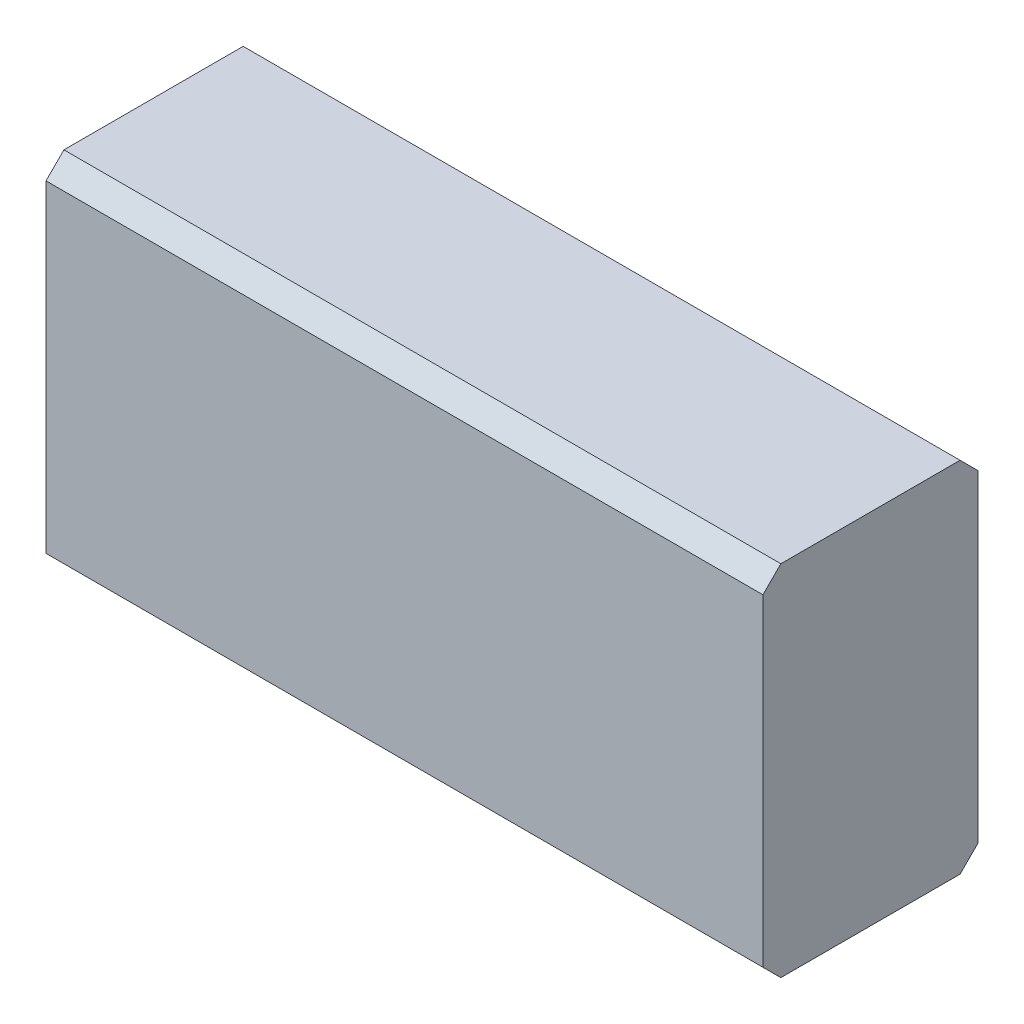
ISO-10303-21;
HEADER;
FILE_DESCRIPTION(('STEP AP214'),'2;1');
FILE_NAME('part.step','',(''),(''),'','','');
FILE_SCHEMA(('AUTOMOTIVE_DESIGN { 1 0 10303 214 1 1 1 1 }'));
ENDSEC;
DATA;
#1=APPLICATION_CONTEXT('core data for automotive mechanical design processes');
#2=APPLICATION_PROTOCOL_DEFINITION('international standard','automotive_design',2000,#1);
#3=PRODUCT_CONTEXT('',#1,'mechanical');
#4=PRODUCT('Part','Part','',(#3));
#5=PRODUCT_RELATED_PRODUCT_CATEGORY('part','',(#4));
#6=PRODUCT_DEFINITION_FORMATION('','',#4);
#7=PRODUCT_DEFINITION_CONTEXT('part definition',#1,'design');
#8=PRODUCT_DEFINITION('design','',#6,#7);
#9=PRODUCT_DEFINITION_SHAPE('','',#8);
#10=(LENGTH_UNIT() NAMED_UNIT(*) SI_UNIT(.MILLI.,.METRE.));
#11=(NAMED_UNIT(*) PLANE_ANGLE_UNIT() SI_UNIT($,.RADIAN.));
#12=(NAMED_UNIT(*) SI_UNIT($,.STERADIAN.) SOLID_ANGLE_UNIT());
#13=UNCERTAINTY_MEASURE_WITH_UNIT(LENGTH_MEASURE(1.E-05),#10,'distance_accuracy_value','');
#14=(GEOMETRIC_REPRESENTATION_CONTEXT(3) GLOBAL_UNCERTAINTY_ASSIGNED_CONTEXT((#13)) GLOBAL_UNIT_ASSIGNED_CONTEXT((#10,
#11,#12)) REPRESENTATION_CONTEXT('',''));
#15=CARTESIAN_POINT('',(0.,0.,0.));
#16=DIRECTION('',(0.,0.,1.));
#17=DIRECTION('',(1.,0.,0.));
#18=AXIS2_PLACEMENT_3D('',#15,#16,#17);
#19=CARTESIAN_POINT('',(2.5,2.5,3.));
#20=DIRECTION('',(-1.,0.,0.));
#21=DIRECTION('',(0.,-1.,0.));
#22=AXIS2_PLACEMENT_3D('',#19,#20,#21);
#23=PLANE('',#22);
#24=DIRECTION('',(0.,1.,0.));
#25=VECTOR('',#24,1.);
#26=CARTESIAN_POINT('',(2.5,2.5,0.));
#27=LINE('',#26,#25);
#28=CARTESIAN_POINT('',(2.5,-2.25,0.));
#29=VERTEX_POINT('',#28);
#30=CARTESIAN_POINT('',(2.5,2.25,0.));
#31=VERTEX_POINT('',#30);
#32=EDGE_CURVE('E158',#29,#31,#27,.T.);
#33=ORIENTED_EDGE('',*,*,#32,.T.);
#34=DIRECTION('',(0.,-0.70710678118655,-0.707106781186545));
#35=VECTOR('',#34,1.);
#36=CARTESIAN_POINT('',(2.5,2.5,0.25));
#37=LINE('',#36,#35);
#38=CARTESIAN_POINT('',(2.5,2.5,0.25));
#39=VERTEX_POINT('',#38);
#40=EDGE_CURVE('E144',#31,#39,#37,.F.);
#41=ORIENTED_EDGE('',*,*,#40,.T.);
#42=DIRECTION('',(0.,0.,-1.));
#43=VECTOR('',#42,1.);
#44=CARTESIAN_POINT('',(2.5,2.5,3.));
#45=LINE('',#44,#43);
#46=CARTESIAN_POINT('',(2.5,2.5,2.75));
#47=VERTEX_POINT('',#46);
#48=EDGE_CURVE('E119',#47,#39,#45,.T.);
#49=ORIENTED_EDGE('',*,*,#48,.F.);
#50=DIRECTION('',(0.,-0.707106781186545,0.70710678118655));
#51=VECTOR('',#50,1.);
#52=CARTESIAN_POINT('',(2.5,2.25,3.));
#53=LINE('',#52,#51);
#54=CARTESIAN_POINT('',(2.5,2.25,3.));
#55=VERTEX_POINT('',#54);
#56=EDGE_CURVE('E124',#47,#55,#53,.T.);
#57=ORIENTED_EDGE('',*,*,#56,.T.);
#58=DIRECTION('',(0.,1.,0.));
#59=VECTOR('',#58,1.);
#60=CARTESIAN_POINT('',(2.5,2.5,3.));
#61=LINE('',#60,#59);
#62=CARTESIAN_POINT('',(2.5,-2.25,3.));
#63=VERTEX_POINT('',#62);
#64=EDGE_CURVE('E120',#63,#55,#61,.T.);
#65=ORIENTED_EDGE('',*,*,#64,.F.);
#66=DIRECTION('',(0.,-0.707106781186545,-0.70710678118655));
#67=VECTOR('',#66,1.);
#68=CARTESIAN_POINT('',(2.5,-2.25,3.));
#69=LINE('',#68,#67);
#70=CARTESIAN_POINT('',(2.5,-2.5,2.75));
#71=VERTEX_POINT('',#70);
#72=EDGE_CURVE('E55',#63,#71,#69,.T.);
#73=ORIENTED_EDGE('',*,*,#72,.T.);
#74=DIRECTION('',(0.,0.,-1.));
#75=VECTOR('',#74,1.);
#76=CARTESIAN_POINT('',(2.5,-2.5,3.));
#77=LINE('',#76,#75);
#78=CARTESIAN_POINT('',(2.5,-2.5,0.25));
#79=VERTEX_POINT('',#78);
#80=EDGE_CURVE('E129',#71,#79,#77,.T.);
#81=ORIENTED_EDGE('',*,*,#80,.T.);
#82=DIRECTION('',(0.,-0.70710678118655,0.707106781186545));
#83=VECTOR('',#82,1.);
#84=CARTESIAN_POINT('',(2.5,-2.5,0.25));
#85=LINE('',#84,#83);
#86=EDGE_CURVE('E47',#79,#29,#85,.F.);
#87=ORIENTED_EDGE('',*,*,#86,.T.);
#88=EDGE_LOOP('',(#33,#41,#49,#57,#65,#73,#81,#87));
#89=FACE_BOUND('',#88,.T.);
#90=ADVANCED_FACE('F32',(#89),#23,.F.);
#91=CARTESIAN_POINT('',(0.,2.5,3.));
#92=DIRECTION('',(0.,-1.,0.));
#93=DIRECTION('',(0.,0.,-1.));
#94=AXIS2_PLACEMENT_3D('',#91,#92,#93);
#95=PLANE('',#94);
#96=ORIENTED_EDGE('',*,*,#48,.T.);
#97=DIRECTION('',(-1.,0.,0.));
#98=VECTOR('',#97,1.);
#99=CARTESIAN_POINT('',(0.,2.5,0.25));
#100=LINE('',#99,#98);
#101=CARTESIAN_POINT('',(-7.50000000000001,2.5,0.25));
#102=VERTEX_POINT('',#101);
#103=EDGE_CURVE('E118',#39,#102,#100,.T.);
#104=ORIENTED_EDGE('',*,*,#103,.T.);
#105=DIRECTION('',(0.,0.,-1.));
#106=VECTOR('',#105,1.);
#107=CARTESIAN_POINT('',(-7.50000000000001,2.5,3.));
#108=LINE('',#107,#106);
#109=CARTESIAN_POINT('',(-7.50000000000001,2.5,2.75));
#110=VERTEX_POINT('',#109);
#111=EDGE_CURVE('E102',#110,#102,#108,.T.);
#112=ORIENTED_EDGE('',*,*,#111,.F.);
#113=DIRECTION('',(1.,0.,0.));
#114=VECTOR('',#113,1.);
#115=CARTESIAN_POINT('',(2.5,2.5,2.75));
#116=LINE('',#115,#114);
#117=EDGE_CURVE('E115',#110,#47,#116,.T.);
#118=ORIENTED_EDGE('',*,*,#117,.T.);
#119=EDGE_LOOP('',(#96,#104,#112,#118));
#120=FACE_BOUND('',#119,.T.);
#121=ADVANCED_FACE('F114',(#120),#95,.F.);
#122=CARTESIAN_POINT('',(-5.,-2.5,3.));
#123=DIRECTION('',(0.,1.,0.));
#124=DIRECTION('',(0.,0.,1.));
#125=AXIS2_PLACEMENT_3D('',#122,#123,#124);
#126=PLANE('',#125);
#127=DIRECTION('',(0.,0.,-1.));
#128=VECTOR('',#127,1.);
#129=CARTESIAN_POINT('',(-7.50000000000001,-2.5,3.));
#130=LINE('',#129,#128);
#131=CARTESIAN_POINT('',(-7.50000000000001,-2.5,2.75));
#132=VERTEX_POINT('',#131);
#133=CARTESIAN_POINT('',(-7.50000000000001,-2.5,0.25));
#134=VERTEX_POINT('',#133);
#135=EDGE_CURVE('E125',#132,#134,#130,.T.);
#136=ORIENTED_EDGE('',*,*,#135,.T.);
#137=DIRECTION('',(1.,0.,0.));
#138=VECTOR('',#137,1.);
#139=CARTESIAN_POINT('',(-5.,-2.5,0.25));
#140=LINE('',#139,#138);
#141=EDGE_CURVE('E148',#134,#79,#140,.T.);
#142=ORIENTED_EDGE('',*,*,#141,.T.);
#143=ORIENTED_EDGE('',*,*,#80,.F.);
#144=DIRECTION('',(-1.,0.,0.));
#145=VECTOR('',#144,1.);
#146=CARTESIAN_POINT('',(-7.50000000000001,-2.5,2.75));
#147=LINE('',#146,#145);
#148=EDGE_CURVE('E146',#71,#132,#147,.T.);
#149=ORIENTED_EDGE('',*,*,#148,.T.);
#150=EDGE_LOOP('',(#136,#142,#143,#149));
#151=FACE_BOUND('',#150,.T.);
#152=ADVANCED_FACE('F168',(#151),#126,.F.);
#153=CARTESIAN_POINT('',(0.,0.,3.));
#154=DIRECTION('',(0.,0.,1.));
#155=DIRECTION('',(1.,0.,0.));
#156=AXIS2_PLACEMENT_3D('',#153,#154,#155);
#157=PLANE('',#156);
#158=ORIENTED_EDGE('',*,*,#64,.T.);
#159=DIRECTION('',(-1.,0.,0.));
#160=VECTOR('',#159,1.);
#161=CARTESIAN_POINT('',(-7.50000000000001,2.25,3.));
#162=LINE('',#161,#160);
#163=CARTESIAN_POINT('',(-7.50000000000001,2.25,3.));
#164=VERTEX_POINT('',#163);
#165=EDGE_CURVE('E11',#55,#164,#162,.T.);
#166=ORIENTED_EDGE('',*,*,#165,.T.);
#167=DIRECTION('',(0.,-1.,0.));
#168=VECTOR('',#167,1.);
#169=CARTESIAN_POINT('',(-7.50000000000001,2.5,3.));
#170=LINE('',#169,#168);
#171=CARTESIAN_POINT('',(-7.50000000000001,-2.25,3.));
#172=VERTEX_POINT('',#171);
#173=EDGE_CURVE('E104',#164,#172,#170,.T.);
#174=ORIENTED_EDGE('',*,*,#173,.T.);
#175=DIRECTION('',(1.,0.,0.));
#176=VECTOR('',#175,1.);
#177=CARTESIAN_POINT('',(2.5,-2.25,3.));
#178=LINE('',#177,#176);
#179=EDGE_CURVE('E40',#172,#63,#178,.T.);
#180=ORIENTED_EDGE('',*,*,#179,.T.);
#181=EDGE_LOOP('',(#158,#166,#174,#180));
#182=FACE_BOUND('',#181,.T.);
#183=ADVANCED_FACE('F153',(#182),#157,.T.);
#184=CARTESIAN_POINT('',(0.,0.,0.));
#185=DIRECTION('',(0.,0.,1.));
#186=DIRECTION('',(1.,0.,0.));
#187=AXIS2_PLACEMENT_3D('',#184,#185,#186);
#188=PLANE('',#187);
#189=DIRECTION('',(0.,-1.,0.));
#190=VECTOR('',#189,1.);
#191=CARTESIAN_POINT('',(-7.50000000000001,2.5,0.));
#192=LINE('',#191,#190);
#193=CARTESIAN_POINT('',(-7.50000000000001,2.25,0.));
#194=VERTEX_POINT('',#193);
#195=CARTESIAN_POINT('',(-7.50000000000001,-2.25,0.));
#196=VERTEX_POINT('',#195);
#197=EDGE_CURVE('E161',#194,#196,#192,.T.);
#198=ORIENTED_EDGE('',*,*,#197,.F.);
#199=DIRECTION('',(1.,0.,0.));
#200=VECTOR('',#199,1.);
#201=CARTESIAN_POINT('',(0.,2.25,0.));
#202=LINE('',#201,#200);
#203=EDGE_CURVE('E139',#194,#31,#202,.T.);
#204=ORIENTED_EDGE('',*,*,#203,.T.);
#205=ORIENTED_EDGE('',*,*,#32,.F.);
#206=DIRECTION('',(-1.,0.,0.));
#207=VECTOR('',#206,1.);
#208=CARTESIAN_POINT('',(0.,-2.25,0.));
#209=LINE('',#208,#207);
#210=EDGE_CURVE('E137',#29,#196,#209,.T.);
#211=ORIENTED_EDGE('',*,*,#210,.T.);
#212=EDGE_LOOP('',(#198,#204,#205,#211));
#213=FACE_BOUND('',#212,.T.);
#214=ADVANCED_FACE('F174',(#213),#188,.F.);
#215=CARTESIAN_POINT('',(-7.50000000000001,2.5,3.));
#216=DIRECTION('',(1.,0.,0.));
#217=DIRECTION('',(0.,1.,0.));
#218=AXIS2_PLACEMENT_3D('',#215,#216,#217);
#219=PLANE('',#218);
#220=ORIENTED_EDGE('',*,*,#111,.T.);
#221=DIRECTION('',(0.,0.70710678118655,0.707106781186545));
#222=VECTOR('',#221,1.);
#223=CARTESIAN_POINT('',(-7.50000000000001,2.5,0.249999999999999));
#224=LINE('',#223,#222);
#225=EDGE_CURVE('E135',#102,#194,#224,.F.);
#226=ORIENTED_EDGE('',*,*,#225,.T.);
#227=ORIENTED_EDGE('',*,*,#197,.T.);
#228=DIRECTION('',(0.,0.70710678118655,-0.707106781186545));
#229=VECTOR('',#228,1.);
#230=CARTESIAN_POINT('',(-7.50000000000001,-2.5,0.250000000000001));
#231=LINE('',#230,#229);
#232=EDGE_CURVE('E108',#196,#134,#231,.F.);
#233=ORIENTED_EDGE('',*,*,#232,.T.);
#234=ORIENTED_EDGE('',*,*,#135,.F.);
#235=DIRECTION('',(0.,0.707106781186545,0.70710678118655));
#236=VECTOR('',#235,1.);
#237=CARTESIAN_POINT('',(-7.50000000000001,-2.25,3.));
#238=LINE('',#237,#236);
#239=EDGE_CURVE('E109',#132,#172,#238,.T.);
#240=ORIENTED_EDGE('',*,*,#239,.T.);
#241=ORIENTED_EDGE('',*,*,#173,.F.);
#242=DIRECTION('',(0.,0.707106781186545,-0.70710678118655));
#243=VECTOR('',#242,1.);
#244=CARTESIAN_POINT('',(-7.50000000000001,2.25,3.));
#245=LINE('',#244,#243);
#246=EDGE_CURVE('E99',#164,#110,#245,.T.);
#247=ORIENTED_EDGE('',*,*,#246,.T.);
#248=EDGE_LOOP('',(#220,#226,#227,#233,#234,#240,#241,#247));
#249=FACE_BOUND('',#248,.T.);
#250=ADVANCED_FACE('F101',(#249),#219,.F.);
#251=CARTESIAN_POINT('',(0.,2.5,0.25));
#252=DIRECTION('',(0.,-0.707106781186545,0.70710678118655));
#253=DIRECTION('',(0.,-0.70710678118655,-0.707106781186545));
#254=AXIS2_PLACEMENT_3D('',#251,#252,#253);
#255=PLANE('',#254);
#256=ORIENTED_EDGE('',*,*,#40,.F.);
#257=ORIENTED_EDGE('',*,*,#203,.F.);
#258=ORIENTED_EDGE('',*,*,#225,.F.);
#259=ORIENTED_EDGE('',*,*,#103,.F.);
#260=EDGE_LOOP('',(#256,#257,#258,#259));
#261=FACE_BOUND('',#260,.T.);
#262=ADVANCED_FACE('F178',(#261),#255,.F.);
#263=CARTESIAN_POINT('',(-5.,-2.5,0.25));
#264=DIRECTION('',(0.,0.707106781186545,0.70710678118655));
#265=DIRECTION('',(0.,-0.70710678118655,0.707106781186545));
#266=AXIS2_PLACEMENT_3D('',#263,#264,#265);
#267=PLANE('',#266);
#268=ORIENTED_EDGE('',*,*,#232,.F.);
#269=ORIENTED_EDGE('',*,*,#210,.F.);
#270=ORIENTED_EDGE('',*,*,#86,.F.);
#271=ORIENTED_EDGE('',*,*,#141,.F.);
#272=EDGE_LOOP('',(#268,#269,#270,#271));
#273=FACE_BOUND('',#272,.T.);
#274=ADVANCED_FACE('F171',(#273),#267,.F.);
#275=CARTESIAN_POINT('',(0.,2.25,3.));
#276=DIRECTION('',(0.,0.70710678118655,0.707106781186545));
#277=DIRECTION('',(0.,-0.707106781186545,0.70710678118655));
#278=AXIS2_PLACEMENT_3D('',#275,#276,#277);
#279=PLANE('',#278);
#280=ORIENTED_EDGE('',*,*,#56,.F.);
#281=ORIENTED_EDGE('',*,*,#117,.F.);
#282=ORIENTED_EDGE('',*,*,#246,.F.);
#283=ORIENTED_EDGE('',*,*,#165,.F.);
#284=EDGE_LOOP('',(#280,#281,#282,#283));
#285=FACE_BOUND('',#284,.T.);
#286=ADVANCED_FACE('F123',(#285),#279,.T.);
#287=CARTESIAN_POINT('',(0.,-2.25,3.));
#288=DIRECTION('',(0.,-0.70710678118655,0.707106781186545));
#289=DIRECTION('',(0.,-0.707106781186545,-0.70710678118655));
#290=AXIS2_PLACEMENT_3D('',#287,#288,#289);
#291=PLANE('',#290);
#292=ORIENTED_EDGE('',*,*,#239,.F.);
#293=ORIENTED_EDGE('',*,*,#148,.F.);
#294=ORIENTED_EDGE('',*,*,#72,.F.);
#295=ORIENTED_EDGE('',*,*,#179,.F.);
#296=EDGE_LOOP('',(#292,#293,#294,#295));
#297=FACE_BOUND('',#296,.T.);
#298=ADVANCED_FACE('F34',(#297),#291,.T.);
#299=CLOSED_SHELL('',(#90,#121,#152,#183,#214,#250,#262,#274,#286,#298));
#300=MANIFOLD_SOLID_BREP('B2',#299);
#301=ADVANCED_BREP_SHAPE_REPRESENTATION('',(#18,#300),#14);
#302=SHAPE_DEFINITION_REPRESENTATION(#9,#301);
ENDSEC;
END-ISO-10303-21;
